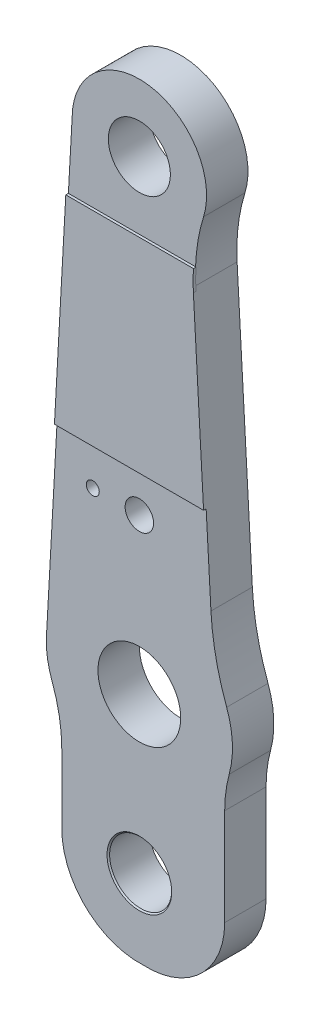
ISO-10303-21;
HEADER;
FILE_DESCRIPTION(('STEP AP214'),'2;1');
FILE_NAME('part.step','',(''),(''),'','','');
FILE_SCHEMA(('AUTOMOTIVE_DESIGN { 1 0 10303 214 1 1 1 1 }'));
ENDSEC;
DATA;
#1=APPLICATION_CONTEXT('core data for automotive mechanical design processes');
#2=APPLICATION_PROTOCOL_DEFINITION('international standard','automotive_design',2000,#1);
#3=PRODUCT_CONTEXT('',#1,'mechanical');
#4=PRODUCT('Part','Part','',(#3));
#5=PRODUCT_RELATED_PRODUCT_CATEGORY('part','',(#4));
#6=PRODUCT_DEFINITION_FORMATION('','',#4);
#7=PRODUCT_DEFINITION_CONTEXT('part definition',#1,'design');
#8=PRODUCT_DEFINITION('design','',#6,#7);
#9=PRODUCT_DEFINITION_SHAPE('','',#8);
#10=(LENGTH_UNIT() NAMED_UNIT(*) SI_UNIT(.MILLI.,.METRE.));
#11=(NAMED_UNIT(*) PLANE_ANGLE_UNIT() SI_UNIT($,.RADIAN.));
#12=(NAMED_UNIT(*) SI_UNIT($,.STERADIAN.) SOLID_ANGLE_UNIT());
#13=UNCERTAINTY_MEASURE_WITH_UNIT(LENGTH_MEASURE(1.E-05),#10,'distance_accuracy_value','');
#14=(GEOMETRIC_REPRESENTATION_CONTEXT(3) GLOBAL_UNCERTAINTY_ASSIGNED_CONTEXT((#13)) GLOBAL_UNIT_ASSIGNED_CONTEXT((#10,
#11,#12)) REPRESENTATION_CONTEXT('',''));
#15=CARTESIAN_POINT('',(0.,0.,0.));
#16=DIRECTION('',(0.,0.,1.));
#17=DIRECTION('',(1.,0.,0.));
#18=AXIS2_PLACEMENT_3D('',#15,#16,#17);
#19=CARTESIAN_POINT('',(3.5527136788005E-12,-179.999999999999,16.));
#20=DIRECTION('',(0.,0.,1.));
#21=DIRECTION('',(0.999999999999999,0.,0.));
#22=AXIS2_PLACEMENT_3D('',#19,#20,#21);
#23=PLANE('',#22);
#24=CARTESIAN_POINT('',(-17.9999999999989,-119.999999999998,16.));
#25=DIRECTION('',(0.,0.,1.));
#26=DIRECTION('',(0.999999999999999,0.,0.));
#27=AXIS2_PLACEMENT_3D('',#24,#25,#26);
#28=CIRCLE('',#27,2.5);
#29=CARTESIAN_POINT('',(-15.4999999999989,-119.999999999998,16.));
#30=VERTEX_POINT('',#29);
#31=EDGE_CURVE('E617',#30,#30,#28,.T.);
#32=ORIENTED_EDGE('',*,*,#31,.F.);
#33=EDGE_LOOP('',(#32));
#34=FACE_BOUND('',#33,.T.);
#35=CARTESIAN_POINT('',(3.5527136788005E-12,-179.999999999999,16.));
#36=DIRECTION('',(0.,0.,1.));
#37=DIRECTION('',(0.999999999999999,0.,0.));
#38=AXIS2_PLACEMENT_3D('',#35,#36,#37);
#39=CIRCLE('',#38,16.);
#40=CARTESIAN_POINT('',(16.0000000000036,-179.999999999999,16.));
#41=VERTEX_POINT('',#40);
#42=EDGE_CURVE('E196',#41,#41,#39,.T.);
#43=ORIENTED_EDGE('',*,*,#42,.F.);
#44=EDGE_LOOP('',(#43));
#45=FACE_BOUND('',#44,.T.);
#46=CARTESIAN_POINT('',(0.,-240.,16.));
#47=DIRECTION('',(0.,0.,1.));
#48=DIRECTION('',(0.999999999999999,0.,0.));
#49=AXIS2_PLACEMENT_3D('',#46,#47,#48);
#50=CIRCLE('',#49,12.5);
#51=CARTESIAN_POINT('',(12.5,-240.,16.));
#52=VERTEX_POINT('',#51);
#53=EDGE_CURVE('E11',#52,#52,#50,.F.);
#54=ORIENTED_EDGE('',*,*,#53,.T.);
#55=EDGE_LOOP('',(#54));
#56=FACE_BOUND('',#55,.T.);
#57=DIRECTION('',(0.999999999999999,0.,0.));
#58=VECTOR('',#57,1.);
#59=CARTESIAN_POINT('',(-31.8333333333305,-105.,16.));
#60=LINE('',#59,#58);
#61=CARTESIAN_POINT('',(-31.8333333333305,-105.,16.));
#62=VERTEX_POINT('',#61);
#63=CARTESIAN_POINT('',(25.8333333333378,-105.000000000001,16.));
#64=VERTEX_POINT('',#63);
#65=EDGE_CURVE('E54',#62,#64,#60,.T.);
#66=ORIENTED_EDGE('',*,*,#65,.F.);
#67=DIRECTION('',(-0.055470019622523,-0.998460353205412,0.));
#68=VECTOR('',#67,1.);
#69=CARTESIAN_POINT('',(-25.9999999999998,0.,16.));
#70=LINE('',#69,#68);
#71=CARTESIAN_POINT('',(-35.7784615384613,-176.012307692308,16.));
#72=VERTEX_POINT('',#71);
#73=EDGE_CURVE('E335',#62,#72,#70,.T.);
#74=ORIENTED_EDGE('',*,*,#73,.T.);
#75=CARTESIAN_POINT('',(3.5527136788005E-12,-179.999999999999,16.));
#76=DIRECTION('',(0.,0.,1.));
#77=DIRECTION('',(0.999999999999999,0.,0.));
#78=AXIS2_PLACEMENT_3D('',#75,#76,#77);
#79=CIRCLE('',#78,36.);
#80=CARTESIAN_POINT('',(-33.7499999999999,-192.527469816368,16.));
#81=VERTEX_POINT('',#80);
#82=EDGE_CURVE('E261',#72,#81,#79,.T.);
#83=ORIENTED_EDGE('',*,*,#82,.T.);
#84=CARTESIAN_POINT('',(-89.9999999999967,-213.406586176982,16.));
#85=DIRECTION('',(0.,0.,-1.));
#86=DIRECTION('',(-0.999999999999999,0.,0.));
#87=AXIS2_PLACEMENT_3D('',#84,#85,#86);
#88=CIRCLE('',#87,60.);
#89=CARTESIAN_POINT('',(-29.9999999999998,-213.40658617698,16.));
#90=VERTEX_POINT('',#89);
#91=EDGE_CURVE('E264',#81,#90,#88,.T.);
#92=ORIENTED_EDGE('',*,*,#91,.T.);
#93=DIRECTION('',(0.,-0.999999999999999,0.));
#94=VECTOR('',#93,1.);
#95=CARTESIAN_POINT('',(-29.9999999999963,-240.000000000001,16.));
#96=LINE('',#95,#94);
#97=CARTESIAN_POINT('',(-29.9999999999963,-240.000000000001,16.));
#98=VERTEX_POINT('',#97);
#99=EDGE_CURVE('E266',#90,#98,#96,.T.);
#100=ORIENTED_EDGE('',*,*,#99,.T.);
#101=CARTESIAN_POINT('',(0.,-240.,16.));
#102=DIRECTION('',(0.,0.,1.));
#103=DIRECTION('',(0.999999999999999,0.,0.));
#104=AXIS2_PLACEMENT_3D('',#101,#102,#103);
#105=CIRCLE('',#104,30.);
#106=CARTESIAN_POINT('',(1.5000000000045,-269.962476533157,16.));
#107=VERTEX_POINT('',#106);
#108=EDGE_CURVE('E268',#98,#107,#105,.T.);
#109=ORIENTED_EDGE('',*,*,#108,.T.);
#110=CARTESIAN_POINT('',(3.00000000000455,-239.999999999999,16.));
#111=DIRECTION('',(0.,0.,1.));
#112=DIRECTION('',(0.999999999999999,0.,0.));
#113=AXIS2_PLACEMENT_3D('',#110,#111,#112);
#114=CIRCLE('',#113,30.);
#115=CARTESIAN_POINT('',(33.0000000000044,-239.999999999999,16.));
#116=VERTEX_POINT('',#115);
#117=EDGE_CURVE('E270',#107,#116,#114,.T.);
#118=ORIENTED_EDGE('',*,*,#117,.T.);
#119=DIRECTION('',(0.,0.999999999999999,0.));
#120=VECTOR('',#119,1.);
#121=CARTESIAN_POINT('',(33.0000000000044,-239.999999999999,16.));
#122=LINE('',#121,#120);
#123=CARTESIAN_POINT('',(32.9999999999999,-202.516660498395,16.));
#124=VERTEX_POINT('',#123);
#125=EDGE_CURVE('E272',#116,#124,#122,.T.);
#126=ORIENTED_EDGE('',*,*,#125,.T.);
#127=CARTESIAN_POINT('',(83.0000000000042,-202.516660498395,16.));
#128=DIRECTION('',(0.,0.,-1.));
#129=DIRECTION('',(-0.999999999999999,0.,0.));
#130=AXIS2_PLACEMENT_3D('',#127,#128,#129);
#131=CIRCLE('',#130,50.);
#132=CARTESIAN_POINT('',(34.7441860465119,-189.425578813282,16.));
#133=VERTEX_POINT('',#132);
#134=EDGE_CURVE('E274',#124,#133,#131,.T.);
#135=ORIENTED_EDGE('',*,*,#134,.T.);
#136=CARTESIAN_POINT('',(3.5527136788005E-12,-179.999999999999,16.));
#137=DIRECTION('',(0.,0.,1.));
#138=DIRECTION('',(0.999999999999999,0.,0.));
#139=AXIS2_PLACEMENT_3D('',#136,#137,#138);
#140=CIRCLE('',#139,36.);
#141=CARTESIAN_POINT('',(33.7577775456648,-167.493503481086,16.));
#142=VERTEX_POINT('',#141);
#143=EDGE_CURVE('E276',#133,#142,#140,.T.);
#144=ORIENTED_EDGE('',*,*,#143,.T.);
#145=CARTESIAN_POINT('',(127.529381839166,-132.753235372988,16.));
#146=DIRECTION('',(0.,0.,-1.));
#147=DIRECTION('',(0.999999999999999,0.,0.));
#148=AXIS2_PLACEMENT_3D('',#145,#146,#147);
#149=CIRCLE('',#148,100.);
#150=CARTESIAN_POINT('',(27.6833465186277,-138.300237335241,16.));
#151=VERTEX_POINT('',#150);
#152=EDGE_CURVE('E278',#142,#151,#149,.T.);
#153=ORIENTED_EDGE('',*,*,#152,.T.);
#154=DIRECTION('',(-0.0554700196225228,0.998460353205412,0.));
#155=VECTOR('',#154,1.);
#156=CARTESIAN_POINT('',(21.7961207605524,-32.3301736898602,16.));
#157=LINE('',#156,#155);
#158=EDGE_CURVE('E288',#151,#64,#157,.T.);
#159=ORIENTED_EDGE('',*,*,#158,.T.);
#160=EDGE_LOOP('',(#66,#74,#83,#92,#100,#109,#118,#126,#135,#144,#153,#159));
#161=FACE_BOUND('',#160,.T.);
#162=CARTESIAN_POINT('',(0.,-120.,16.));
#163=DIRECTION('',(0.,0.,1.));
#164=DIRECTION('',(0.999999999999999,0.,0.));
#165=AXIS2_PLACEMENT_3D('',#162,#163,#164);
#166=CIRCLE('',#165,5.5);
#167=CARTESIAN_POINT('',(5.49999999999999,-120.,16.));
#168=VERTEX_POINT('',#167);
#169=EDGE_CURVE('E222',#168,#168,#166,.T.);
#170=ORIENTED_EDGE('',*,*,#169,.F.);
#171=EDGE_LOOP('',(#170));
#172=FACE_BOUND('',#171,.T.);
#173=ADVANCED_FACE('F39',(#34,#45,#56,#161,#172),#23,.T.);
#174=DIRECTION('',(-0.999999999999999,0.,0.));
#175=VECTOR('',#174,1.);
#176=CARTESIAN_POINT('',(-27.4444444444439,-25.9999999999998,16.));
#177=LINE('',#176,#175);
#178=CARTESIAN_POINT('',(21.7311381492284,-26.0000000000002,16.));
#179=VERTEX_POINT('',#178);
#180=CARTESIAN_POINT('',(-27.4444444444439,-25.9999999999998,16.));
#181=VERTEX_POINT('',#180);
#182=EDGE_CURVE('E62',#179,#181,#177,.T.);
#183=ORIENTED_EDGE('',*,*,#182,.F.);
#184=CARTESIAN_POINT('',(91.6883454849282,-28.4472723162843,16.));
#185=DIRECTION('',(0.,0.,-1.));
#186=DIRECTION('',(-0.999999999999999,0.,0.));
#187=AXIS2_PLACEMENT_3D('',#184,#185,#186);
#188=CIRCLE('',#187,70.);
#189=CARTESIAN_POINT('',(24.8322602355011,-7.70446958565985,16.));
#190=VERTEX_POINT('',#189);
#191=EDGE_CURVE('E290',#179,#190,#188,.T.);
#192=ORIENTED_EDGE('',*,*,#191,.T.);
#193=CARTESIAN_POINT('',(0.,0.,16.));
#194=DIRECTION('',(0.,0.,1.));
#195=DIRECTION('',(0.999999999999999,0.,0.));
#196=AXIS2_PLACEMENT_3D('',#193,#194,#195);
#197=CIRCLE('',#196,26.);
#198=CARTESIAN_POINT('',(-25.9999999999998,0.,16.));
#199=VERTEX_POINT('',#198);
#200=EDGE_CURVE('E332',#190,#199,#197,.T.);
#201=ORIENTED_EDGE('',*,*,#200,.T.);
#202=EDGE_CURVE('E330',#199,#181,#70,.T.);
#203=ORIENTED_EDGE('',*,*,#202,.T.);
#204=EDGE_LOOP('',(#183,#192,#201,#203));
#205=FACE_BOUND('',#204,.T.);
#206=CARTESIAN_POINT('',(0.,0.,16.));
#207=DIRECTION('',(0.,0.,1.));
#208=DIRECTION('',(0.999999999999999,0.,0.));
#209=AXIS2_PLACEMENT_3D('',#206,#207,#208);
#210=CIRCLE('',#209,12.);
#211=CARTESIAN_POINT('',(12.,0.,16.));
#212=VERTEX_POINT('',#211);
#213=EDGE_CURVE('E231',#212,#212,#210,.T.);
#214=ORIENTED_EDGE('',*,*,#213,.F.);
#215=EDGE_LOOP('',(#214));
#216=FACE_BOUND('',#215,.T.);
#217=ADVANCED_FACE('F342',(#205,#216),#23,.T.);
#218=CARTESIAN_POINT('',(3.5527136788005E-12,-179.999999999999,0.));
#219=DIRECTION('',(0.,0.,1.));
#220=DIRECTION('',(0.999999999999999,0.,0.));
#221=AXIS2_PLACEMENT_3D('',#218,#219,#220);
#222=PLANE('',#221);
#223=CARTESIAN_POINT('',(-17.9999999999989,-119.999999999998,0.));
#224=DIRECTION('',(0.,0.,1.));
#225=DIRECTION('',(0.999999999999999,0.,0.));
#226=AXIS2_PLACEMENT_3D('',#223,#224,#225);
#227=CIRCLE('',#226,2.5);
#228=CARTESIAN_POINT('',(-15.4999999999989,-119.999999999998,0.));
#229=VERTEX_POINT('',#228);
#230=EDGE_CURVE('E615',#229,#229,#227,.T.);
#231=ORIENTED_EDGE('',*,*,#230,.T.);
#232=EDGE_LOOP('',(#231));
#233=FACE_BOUND('',#232,.T.);
#234=CARTESIAN_POINT('',(3.5527136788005E-12,-179.999999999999,0.));
#235=DIRECTION('',(0.,0.,1.));
#236=DIRECTION('',(0.999999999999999,0.,0.));
#237=AXIS2_PLACEMENT_3D('',#234,#235,#236);
#238=CIRCLE('',#237,16.);
#239=CARTESIAN_POINT('',(16.0000000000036,-179.999999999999,0.));
#240=VERTEX_POINT('',#239);
#241=EDGE_CURVE('E193',#240,#240,#238,.T.);
#242=ORIENTED_EDGE('',*,*,#241,.T.);
#243=EDGE_LOOP('',(#242));
#244=FACE_BOUND('',#243,.T.);
#245=CARTESIAN_POINT('',(0.,-240.,0.));
#246=DIRECTION('',(0.,0.,1.));
#247=DIRECTION('',(0.999999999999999,0.,0.));
#248=AXIS2_PLACEMENT_3D('',#245,#246,#247);
#249=CIRCLE('',#248,12.);
#250=CARTESIAN_POINT('',(12.,-240.,0.));
#251=VERTEX_POINT('',#250);
#252=EDGE_CURVE('E225',#251,#251,#249,.T.);
#253=ORIENTED_EDGE('',*,*,#252,.T.);
#254=EDGE_LOOP('',(#253));
#255=FACE_BOUND('',#254,.T.);
#256=CARTESIAN_POINT('',(3.5527136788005E-12,-179.999999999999,0.));
#257=DIRECTION('',(0.,0.,1.));
#258=DIRECTION('',(0.999999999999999,0.,0.));
#259=AXIS2_PLACEMENT_3D('',#256,#257,#258);
#260=CIRCLE('',#259,36.);
#261=CARTESIAN_POINT('',(-35.7784615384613,-176.012307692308,0.));
#262=VERTEX_POINT('',#261);
#263=CARTESIAN_POINT('',(-33.7499999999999,-192.527469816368,0.));
#264=VERTEX_POINT('',#263);
#265=EDGE_CURVE('E234',#262,#264,#260,.T.);
#266=ORIENTED_EDGE('',*,*,#265,.F.);
#267=DIRECTION('',(-0.055470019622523,-0.998460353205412,0.));
#268=VECTOR('',#267,1.);
#269=CARTESIAN_POINT('',(-25.9999999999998,0.,0.));
#270=LINE('',#269,#268);
#271=CARTESIAN_POINT('',(-25.9999999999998,0.,0.));
#272=VERTEX_POINT('',#271);
#273=EDGE_CURVE('E259',#272,#262,#270,.T.);
#274=ORIENTED_EDGE('',*,*,#273,.F.);
#275=CARTESIAN_POINT('',(0.,0.,0.));
#276=DIRECTION('',(0.,0.,1.));
#277=DIRECTION('',(0.999999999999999,0.,0.));
#278=AXIS2_PLACEMENT_3D('',#275,#276,#277);
#279=CIRCLE('',#278,26.);
#280=CARTESIAN_POINT('',(24.8322602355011,-7.70446958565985,0.));
#281=VERTEX_POINT('',#280);
#282=EDGE_CURVE('E257',#281,#272,#279,.T.);
#283=ORIENTED_EDGE('',*,*,#282,.F.);
#284=CARTESIAN_POINT('',(91.6883454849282,-28.4472723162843,0.));
#285=DIRECTION('',(0.,0.,-1.));
#286=DIRECTION('',(-0.999999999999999,0.,0.));
#287=AXIS2_PLACEMENT_3D('',#284,#285,#286);
#288=CIRCLE('',#287,70.);
#289=CARTESIAN_POINT('',(21.7961207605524,-32.3301736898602,0.));
#290=VERTEX_POINT('',#289);
#291=EDGE_CURVE('E255',#290,#281,#288,.T.);
#292=ORIENTED_EDGE('',*,*,#291,.F.);
#293=DIRECTION('',(-0.0554700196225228,0.998460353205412,0.));
#294=VECTOR('',#293,1.);
#295=CARTESIAN_POINT('',(21.7961207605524,-32.3301736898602,0.));
#296=LINE('',#295,#294);
#297=CARTESIAN_POINT('',(27.6833465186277,-138.300237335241,0.));
#298=VERTEX_POINT('',#297);
#299=EDGE_CURVE('E253',#298,#290,#296,.T.);
#300=ORIENTED_EDGE('',*,*,#299,.F.);
#301=CARTESIAN_POINT('',(127.529381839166,-132.753235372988,0.));
#302=DIRECTION('',(0.,0.,-1.));
#303=DIRECTION('',(0.999999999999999,0.,0.));
#304=AXIS2_PLACEMENT_3D('',#301,#302,#303);
#305=CIRCLE('',#304,100.);
#306=CARTESIAN_POINT('',(33.7577775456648,-167.493503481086,0.));
#307=VERTEX_POINT('',#306);
#308=EDGE_CURVE('E251',#307,#298,#305,.T.);
#309=ORIENTED_EDGE('',*,*,#308,.F.);
#310=CARTESIAN_POINT('',(3.5527136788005E-12,-179.999999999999,0.));
#311=DIRECTION('',(0.,0.,1.));
#312=DIRECTION('',(0.999999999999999,0.,0.));
#313=AXIS2_PLACEMENT_3D('',#310,#311,#312);
#314=CIRCLE('',#313,36.);
#315=CARTESIAN_POINT('',(34.7441860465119,-189.425578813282,0.));
#316=VERTEX_POINT('',#315);
#317=EDGE_CURVE('E249',#316,#307,#314,.T.);
#318=ORIENTED_EDGE('',*,*,#317,.F.);
#319=CARTESIAN_POINT('',(83.0000000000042,-202.516660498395,0.));
#320=DIRECTION('',(0.,0.,-1.));
#321=DIRECTION('',(-0.999999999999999,0.,0.));
#322=AXIS2_PLACEMENT_3D('',#319,#320,#321);
#323=CIRCLE('',#322,50.);
#324=CARTESIAN_POINT('',(32.9999999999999,-202.516660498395,0.));
#325=VERTEX_POINT('',#324);
#326=EDGE_CURVE('E247',#325,#316,#323,.T.);
#327=ORIENTED_EDGE('',*,*,#326,.F.);
#328=DIRECTION('',(0.,0.999999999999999,0.));
#329=VECTOR('',#328,1.);
#330=CARTESIAN_POINT('',(33.0000000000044,-239.999999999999,0.));
#331=LINE('',#330,#329);
#332=CARTESIAN_POINT('',(33.0000000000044,-239.999999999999,0.));
#333=VERTEX_POINT('',#332);
#334=EDGE_CURVE('E245',#333,#325,#331,.T.);
#335=ORIENTED_EDGE('',*,*,#334,.F.);
#336=CARTESIAN_POINT('',(3.00000000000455,-239.999999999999,0.));
#337=DIRECTION('',(0.,0.,1.));
#338=DIRECTION('',(0.999999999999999,0.,0.));
#339=AXIS2_PLACEMENT_3D('',#336,#337,#338);
#340=CIRCLE('',#339,30.);
#341=CARTESIAN_POINT('',(1.5000000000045,-269.962476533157,0.));
#342=VERTEX_POINT('',#341);
#343=EDGE_CURVE('E243',#342,#333,#340,.T.);
#344=ORIENTED_EDGE('',*,*,#343,.F.);
#345=CARTESIAN_POINT('',(0.,-240.,0.));
#346=DIRECTION('',(0.,0.,1.));
#347=DIRECTION('',(0.999999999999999,0.,0.));
#348=AXIS2_PLACEMENT_3D('',#345,#346,#347);
#349=CIRCLE('',#348,30.);
#350=CARTESIAN_POINT('',(-29.9999999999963,-240.000000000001,0.));
#351=VERTEX_POINT('',#350);
#352=EDGE_CURVE('E241',#351,#342,#349,.T.);
#353=ORIENTED_EDGE('',*,*,#352,.F.);
#354=DIRECTION('',(0.,-0.999999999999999,0.));
#355=VECTOR('',#354,1.);
#356=CARTESIAN_POINT('',(-29.9999999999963,-240.000000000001,0.));
#357=LINE('',#356,#355);
#358=CARTESIAN_POINT('',(-29.9999999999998,-213.40658617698,0.));
#359=VERTEX_POINT('',#358);
#360=EDGE_CURVE('E239',#359,#351,#357,.T.);
#361=ORIENTED_EDGE('',*,*,#360,.F.);
#362=CARTESIAN_POINT('',(-89.9999999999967,-213.406586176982,0.));
#363=DIRECTION('',(0.,0.,-1.));
#364=DIRECTION('',(-0.999999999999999,0.,0.));
#365=AXIS2_PLACEMENT_3D('',#362,#363,#364);
#366=CIRCLE('',#365,60.);
#367=EDGE_CURVE('E237',#264,#359,#366,.T.);
#368=ORIENTED_EDGE('',*,*,#367,.F.);
#369=EDGE_LOOP('',(#266,#274,#283,#292,#300,#309,#318,#327,#335,#344,#353,#361,#368));
#370=FACE_BOUND('',#369,.T.);
#371=CARTESIAN_POINT('',(0.,0.,0.));
#372=DIRECTION('',(0.,0.,1.));
#373=DIRECTION('',(0.999999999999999,0.,0.));
#374=AXIS2_PLACEMENT_3D('',#371,#372,#373);
#375=CIRCLE('',#374,12.);
#376=CARTESIAN_POINT('',(12.,0.,0.));
#377=VERTEX_POINT('',#376);
#378=EDGE_CURVE('E228',#377,#377,#375,.T.);
#379=ORIENTED_EDGE('',*,*,#378,.T.);
#380=EDGE_LOOP('',(#379));
#381=FACE_BOUND('',#380,.T.);
#382=CARTESIAN_POINT('',(0.,-120.,0.));
#383=DIRECTION('',(0.,0.,1.));
#384=DIRECTION('',(0.999999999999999,0.,0.));
#385=AXIS2_PLACEMENT_3D('',#382,#383,#384);
#386=CIRCLE('',#385,5.5);
#387=CARTESIAN_POINT('',(5.49999999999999,-120.,0.));
#388=VERTEX_POINT('',#387);
#389=EDGE_CURVE('E186',#388,#388,#386,.T.);
#390=ORIENTED_EDGE('',*,*,#389,.T.);
#391=EDGE_LOOP('',(#390));
#392=FACE_BOUND('',#391,.T.);
#393=ADVANCED_FACE('F416',(#233,#244,#255,#370,#381,#392),#222,.F.);
#394=CARTESIAN_POINT('',(3.5527136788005E-12,-179.999999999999,16.));
#395=DIRECTION('',(0.,0.,-1.));
#396=DIRECTION('',(-0.999999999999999,0.,0.));
#397=AXIS2_PLACEMENT_3D('',#394,#395,#396);
#398=CYLINDRICAL_SURFACE('',#397,36.);
#399=ORIENTED_EDGE('',*,*,#265,.T.);
#400=DIRECTION('',(0.,0.,-1.));
#401=VECTOR('',#400,1.);
#402=CARTESIAN_POINT('',(-33.7499999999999,-192.527469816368,16.));
#403=LINE('',#402,#401);
#404=EDGE_CURVE('E291',#81,#264,#403,.T.);
#405=ORIENTED_EDGE('',*,*,#404,.F.);
#406=ORIENTED_EDGE('',*,*,#82,.F.);
#407=DIRECTION('',(0.,0.,-1.));
#408=VECTOR('',#407,1.);
#409=CARTESIAN_POINT('',(-35.7784615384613,-176.012307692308,16.));
#410=LINE('',#409,#408);
#411=EDGE_CURVE('E327',#72,#262,#410,.T.);
#412=ORIENTED_EDGE('',*,*,#411,.T.);
#413=EDGE_LOOP('',(#399,#405,#406,#412));
#414=FACE_BOUND('',#413,.T.);
#415=ADVANCED_FACE('F41',(#414),#398,.T.);
#416=CARTESIAN_POINT('',(-89.9999999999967,-213.406586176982,16.));
#417=DIRECTION('',(0.,0.,-1.));
#418=DIRECTION('',(-0.999999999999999,0.,0.));
#419=AXIS2_PLACEMENT_3D('',#416,#417,#418);
#420=CYLINDRICAL_SURFACE('',#419,60.);
#421=ORIENTED_EDGE('',*,*,#367,.T.);
#422=DIRECTION('',(0.,0.,-1.));
#423=VECTOR('',#422,1.);
#424=CARTESIAN_POINT('',(-29.9999999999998,-213.40658617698,16.));
#425=LINE('',#424,#423);
#426=EDGE_CURVE('E294',#90,#359,#425,.T.);
#427=ORIENTED_EDGE('',*,*,#426,.F.);
#428=ORIENTED_EDGE('',*,*,#91,.F.);
#429=ORIENTED_EDGE('',*,*,#404,.T.);
#430=EDGE_LOOP('',(#421,#427,#428,#429));
#431=FACE_BOUND('',#430,.T.);
#432=ADVANCED_FACE('F380',(#431),#420,.F.);
#433=CARTESIAN_POINT('',(-29.9999999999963,-240.000000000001,16.));
#434=DIRECTION('',(0.999999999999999,0.,0.));
#435=DIRECTION('',(0.,0.,-1.));
#436=AXIS2_PLACEMENT_3D('',#433,#434,#435);
#437=PLANE('',#436);
#438=ORIENTED_EDGE('',*,*,#360,.T.);
#439=DIRECTION('',(0.,0.,-1.));
#440=VECTOR('',#439,1.);
#441=CARTESIAN_POINT('',(-29.9999999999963,-240.000000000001,16.));
#442=LINE('',#441,#440);
#443=EDGE_CURVE('E297',#98,#351,#442,.T.);
#444=ORIENTED_EDGE('',*,*,#443,.F.);
#445=ORIENTED_EDGE('',*,*,#99,.F.);
#446=ORIENTED_EDGE('',*,*,#426,.T.);
#447=EDGE_LOOP('',(#438,#444,#445,#446));
#448=FACE_BOUND('',#447,.T.);
#449=ADVANCED_FACE('F383',(#448),#437,.F.);
#450=CARTESIAN_POINT('',(0.,-240.,16.));
#451=DIRECTION('',(0.,0.,-1.));
#452=DIRECTION('',(-0.999999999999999,0.,0.));
#453=AXIS2_PLACEMENT_3D('',#450,#451,#452);
#454=CYLINDRICAL_SURFACE('',#453,30.);
#455=ORIENTED_EDGE('',*,*,#352,.T.);
#456=DIRECTION('',(0.,0.,-1.));
#457=VECTOR('',#456,1.);
#458=CARTESIAN_POINT('',(1.5000000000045,-269.962476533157,16.));
#459=LINE('',#458,#457);
#460=EDGE_CURVE('E300',#107,#342,#459,.T.);
#461=ORIENTED_EDGE('',*,*,#460,.F.);
#462=ORIENTED_EDGE('',*,*,#108,.F.);
#463=ORIENTED_EDGE('',*,*,#443,.T.);
#464=EDGE_LOOP('',(#455,#461,#462,#463));
#465=FACE_BOUND('',#464,.T.);
#466=ADVANCED_FACE('F388',(#465),#454,.T.);
#467=CARTESIAN_POINT('',(3.00000000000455,-239.999999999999,16.));
#468=DIRECTION('',(0.,0.,-1.));
#469=DIRECTION('',(-0.999999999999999,0.,0.));
#470=AXIS2_PLACEMENT_3D('',#467,#468,#469);
#471=CYLINDRICAL_SURFACE('',#470,30.);
#472=ORIENTED_EDGE('',*,*,#343,.T.);
#473=DIRECTION('',(0.,0.,-1.));
#474=VECTOR('',#473,1.);
#475=CARTESIAN_POINT('',(33.0000000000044,-239.999999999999,16.));
#476=LINE('',#475,#474);
#477=EDGE_CURVE('E303',#116,#333,#476,.T.);
#478=ORIENTED_EDGE('',*,*,#477,.F.);
#479=ORIENTED_EDGE('',*,*,#117,.F.);
#480=ORIENTED_EDGE('',*,*,#460,.T.);
#481=EDGE_LOOP('',(#472,#478,#479,#480));
#482=FACE_BOUND('',#481,.T.);
#483=ADVANCED_FACE('F394',(#482),#471,.T.);
#484=CARTESIAN_POINT('',(33.0000000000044,-239.999999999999,16.));
#485=DIRECTION('',(-0.999999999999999,0.,0.));
#486=DIRECTION('',(0.,-0.999999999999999,0.));
#487=AXIS2_PLACEMENT_3D('',#484,#485,#486);
#488=PLANE('',#487);
#489=ORIENTED_EDGE('',*,*,#334,.T.);
#490=DIRECTION('',(0.,0.,-1.));
#491=VECTOR('',#490,1.);
#492=CARTESIAN_POINT('',(32.9999999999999,-202.516660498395,16.));
#493=LINE('',#492,#491);
#494=EDGE_CURVE('E306',#124,#325,#493,.T.);
#495=ORIENTED_EDGE('',*,*,#494,.F.);
#496=ORIENTED_EDGE('',*,*,#125,.F.);
#497=ORIENTED_EDGE('',*,*,#477,.T.);
#498=EDGE_LOOP('',(#489,#495,#496,#497));
#499=FACE_BOUND('',#498,.T.);
#500=ADVANCED_FACE('F398',(#499),#488,.F.);
#501=CARTESIAN_POINT('',(83.0000000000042,-202.516660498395,16.));
#502=DIRECTION('',(0.,0.,-1.));
#503=DIRECTION('',(-0.999999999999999,0.,0.));
#504=AXIS2_PLACEMENT_3D('',#501,#502,#503);
#505=CYLINDRICAL_SURFACE('',#504,50.);
#506=ORIENTED_EDGE('',*,*,#326,.T.);
#507=DIRECTION('',(0.,0.,-1.));
#508=VECTOR('',#507,1.);
#509=CARTESIAN_POINT('',(34.7441860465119,-189.425578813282,16.));
#510=LINE('',#509,#508);
#511=EDGE_CURVE('E309',#133,#316,#510,.T.);
#512=ORIENTED_EDGE('',*,*,#511,.F.);
#513=ORIENTED_EDGE('',*,*,#134,.F.);
#514=ORIENTED_EDGE('',*,*,#494,.T.);
#515=EDGE_LOOP('',(#506,#512,#513,#514));
#516=FACE_BOUND('',#515,.T.);
#517=ADVANCED_FACE('F403',(#516),#505,.F.);
#518=CARTESIAN_POINT('',(3.5527136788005E-12,-179.999999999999,16.));
#519=DIRECTION('',(0.,0.,-1.));
#520=DIRECTION('',(-0.999999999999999,0.,0.));
#521=AXIS2_PLACEMENT_3D('',#518,#519,#520);
#522=CYLINDRICAL_SURFACE('',#521,36.);
#523=ORIENTED_EDGE('',*,*,#317,.T.);
#524=DIRECTION('',(0.,0.,-1.));
#525=VECTOR('',#524,1.);
#526=CARTESIAN_POINT('',(33.7577775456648,-167.493503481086,16.));
#527=LINE('',#526,#525);
#528=EDGE_CURVE('E312',#142,#307,#527,.T.);
#529=ORIENTED_EDGE('',*,*,#528,.F.);
#530=ORIENTED_EDGE('',*,*,#143,.F.);
#531=ORIENTED_EDGE('',*,*,#511,.T.);
#532=EDGE_LOOP('',(#523,#529,#530,#531));
#533=FACE_BOUND('',#532,.T.);
#534=ADVANCED_FACE('F409',(#533),#522,.T.);
#535=CARTESIAN_POINT('',(127.529381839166,-132.753235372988,16.));
#536=DIRECTION('',(0.,0.,-1.));
#537=DIRECTION('',(-0.999999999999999,0.,0.));
#538=AXIS2_PLACEMENT_3D('',#535,#536,#537);
#539=CYLINDRICAL_SURFACE('',#538,100.);
#540=ORIENTED_EDGE('',*,*,#308,.T.);
#541=DIRECTION('',(0.,0.,-1.));
#542=VECTOR('',#541,1.);
#543=CARTESIAN_POINT('',(27.6833465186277,-138.300237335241,16.));
#544=LINE('',#543,#542);
#545=EDGE_CURVE('E315',#151,#298,#544,.T.);
#546=ORIENTED_EDGE('',*,*,#545,.F.);
#547=ORIENTED_EDGE('',*,*,#152,.F.);
#548=ORIENTED_EDGE('',*,*,#528,.T.);
#549=EDGE_LOOP('',(#540,#546,#547,#548));
#550=FACE_BOUND('',#549,.T.);
#551=ADVANCED_FACE('F413',(#550),#539,.F.);
#552=CARTESIAN_POINT('',(21.7961207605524,-32.3301736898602,16.));
#553=DIRECTION('',(-0.998460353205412,-0.0554700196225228,0.));
#554=DIRECTION('',(0.0554700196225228,-0.998460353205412,0.));
#555=AXIS2_PLACEMENT_3D('',#552,#553,#554);
#556=PLANE('',#555);
#557=ORIENTED_EDGE('',*,*,#299,.T.);
#558=DIRECTION('',(0.,0.,-1.));
#559=VECTOR('',#558,1.);
#560=CARTESIAN_POINT('',(21.7961207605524,-32.3301736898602,16.));
#561=LINE('',#560,#559);
#562=CARTESIAN_POINT('',(21.7961207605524,-32.3301736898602,16.));
#563=VERTEX_POINT('',#562);
#564=EDGE_CURVE('E318',#563,#290,#561,.T.);
#565=ORIENTED_EDGE('',*,*,#564,.F.);
#566=CARTESIAN_POINT('',(21.896484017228,-34.1367123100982,16.));
#567=VERTEX_POINT('',#566);
#568=EDGE_CURVE('E280',#567,#563,#157,.T.);
#569=ORIENTED_EDGE('',*,*,#568,.F.);
#570=DIRECTION('',(0.,0.,-1.));
#571=VECTOR('',#570,1.);
#572=CARTESIAN_POINT('',(21.8964840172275,-34.1367123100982,16.9999999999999));
#573=LINE('',#572,#571);
#574=CARTESIAN_POINT('',(21.8964840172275,-34.1367123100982,16.9999999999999));
#575=VERTEX_POINT('',#574);
#576=EDGE_CURVE('E192',#575,#567,#573,.T.);
#577=ORIENTED_EDGE('',*,*,#576,.F.);
#578=DIRECTION('',(-0.0554700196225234,0.998460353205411,0.));
#579=VECTOR('',#578,1.);
#580=CARTESIAN_POINT('',(21.8964840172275,-34.1367123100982,16.9999999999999));
#581=LINE('',#580,#579);
#582=CARTESIAN_POINT('',(25.8333333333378,-105.000000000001,16.9999999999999));
#583=VERTEX_POINT('',#582);
#584=EDGE_CURVE('E218',#583,#575,#581,.T.);
#585=ORIENTED_EDGE('',*,*,#584,.F.);
#586=DIRECTION('',(0.,0.,-1.));
#587=VECTOR('',#586,1.);
#588=CARTESIAN_POINT('',(25.8333333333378,-105.000000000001,16.9999999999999));
#589=LINE('',#588,#587);
#590=EDGE_CURVE('E207',#583,#64,#589,.T.);
#591=ORIENTED_EDGE('',*,*,#590,.T.);
#592=ORIENTED_EDGE('',*,*,#158,.F.);
#593=ORIENTED_EDGE('',*,*,#545,.T.);
#594=EDGE_LOOP('',(#557,#565,#569,#577,#585,#591,#592,#593));
#595=FACE_BOUND('',#594,.T.);
#596=ADVANCED_FACE('F367',(#595),#556,.F.);
#597=CARTESIAN_POINT('',(91.6883454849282,-28.4472723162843,16.));
#598=DIRECTION('',(0.,0.,-1.));
#599=DIRECTION('',(-0.999999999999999,0.,0.));
#600=AXIS2_PLACEMENT_3D('',#597,#598,#599);
#601=CYLINDRICAL_SURFACE('',#600,70.);
#602=ORIENTED_EDGE('',*,*,#291,.T.);
#603=DIRECTION('',(0.,0.,-1.));
#604=VECTOR('',#603,1.);
#605=CARTESIAN_POINT('',(24.8322602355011,-7.70446958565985,16.));
#606=LINE('',#605,#604);
#607=EDGE_CURVE('E321',#190,#281,#606,.T.);
#608=ORIENTED_EDGE('',*,*,#607,.F.);
#609=ORIENTED_EDGE('',*,*,#191,.F.);
#610=EDGE_CURVE('E175',#563,#179,#188,.T.);
#611=ORIENTED_EDGE('',*,*,#610,.F.);
#612=ORIENTED_EDGE('',*,*,#564,.T.);
#613=EDGE_LOOP('',(#602,#608,#609,#611,#612));
#614=FACE_BOUND('',#613,.T.);
#615=ADVANCED_FACE('F345',(#614),#601,.F.);
#616=CARTESIAN_POINT('',(0.,0.,16.));
#617=DIRECTION('',(0.,0.,-1.));
#618=DIRECTION('',(-0.999999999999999,0.,0.));
#619=AXIS2_PLACEMENT_3D('',#616,#617,#618);
#620=CYLINDRICAL_SURFACE('',#619,26.);
#621=ORIENTED_EDGE('',*,*,#282,.T.);
#622=DIRECTION('',(0.,0.,-1.));
#623=VECTOR('',#622,1.);
#624=CARTESIAN_POINT('',(-25.9999999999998,0.,16.));
#625=LINE('',#624,#623);
#626=EDGE_CURVE('E324',#199,#272,#625,.T.);
#627=ORIENTED_EDGE('',*,*,#626,.F.);
#628=ORIENTED_EDGE('',*,*,#200,.F.);
#629=ORIENTED_EDGE('',*,*,#607,.T.);
#630=EDGE_LOOP('',(#621,#627,#628,#629));
#631=FACE_BOUND('',#630,.T.);
#632=ADVANCED_FACE('F349',(#631),#620,.T.);
#633=CARTESIAN_POINT('',(-25.9999999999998,0.,16.));
#634=DIRECTION('',(0.998460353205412,-0.055470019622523,0.));
#635=DIRECTION('',(0.055470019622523,0.998460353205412,0.));
#636=AXIS2_PLACEMENT_3D('',#633,#634,#635);
#637=PLANE('',#636);
#638=ORIENTED_EDGE('',*,*,#273,.T.);
#639=ORIENTED_EDGE('',*,*,#411,.F.);
#640=ORIENTED_EDGE('',*,*,#73,.F.);
#641=DIRECTION('',(0.,0.,-1.));
#642=VECTOR('',#641,1.);
#643=CARTESIAN_POINT('',(-31.8333333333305,-105.,16.9999999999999));
#644=LINE('',#643,#642);
#645=CARTESIAN_POINT('',(-31.8333333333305,-105.,16.9999999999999));
#646=VERTEX_POINT('',#645);
#647=EDGE_CURVE('E356',#646,#62,#644,.T.);
#648=ORIENTED_EDGE('',*,*,#647,.F.);
#649=DIRECTION('',(-0.055470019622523,-0.998460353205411,0.));
#650=VECTOR('',#649,1.);
#651=CARTESIAN_POINT('',(-27.4444444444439,-25.9999999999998,16.9999999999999));
#652=LINE('',#651,#650);
#653=CARTESIAN_POINT('',(-27.4444444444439,-25.9999999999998,16.9999999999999));
#654=VERTEX_POINT('',#653);
#655=EDGE_CURVE('E214',#654,#646,#652,.T.);
#656=ORIENTED_EDGE('',*,*,#655,.F.);
#657=DIRECTION('',(0.,0.,-1.));
#658=VECTOR('',#657,1.);
#659=CARTESIAN_POINT('',(-27.4444444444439,-25.9999999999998,16.9999999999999));
#660=LINE('',#659,#658);
#661=EDGE_CURVE('E187',#654,#181,#660,.T.);
#662=ORIENTED_EDGE('',*,*,#661,.T.);
#663=ORIENTED_EDGE('',*,*,#202,.F.);
#664=ORIENTED_EDGE('',*,*,#626,.T.);
#665=EDGE_LOOP('',(#638,#639,#640,#648,#656,#662,#663,#664));
#666=FACE_BOUND('',#665,.T.);
#667=ADVANCED_FACE('F353',(#666),#637,.F.);
#668=CARTESIAN_POINT('',(0.,0.,16.));
#669=DIRECTION('',(0.,0.,-1.));
#670=DIRECTION('',(-0.999999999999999,0.,0.));
#671=AXIS2_PLACEMENT_3D('',#668,#669,#670);
#672=CYLINDRICAL_SURFACE('',#671,12.);
#673=ORIENTED_EDGE('',*,*,#213,.T.);
#674=EDGE_LOOP('',(#673));
#675=FACE_BOUND('',#674,.T.);
#676=ORIENTED_EDGE('',*,*,#378,.F.);
#677=EDGE_LOOP('',(#676));
#678=FACE_BOUND('',#677,.T.);
#679=ADVANCED_FACE('F435',(#675,#678),#672,.F.);
#680=CARTESIAN_POINT('',(0.,-240.,16.));
#681=DIRECTION('',(0.,0.,-1.));
#682=DIRECTION('',(-0.999999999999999,0.,0.));
#683=AXIS2_PLACEMENT_3D('',#680,#681,#682);
#684=CYLINDRICAL_SURFACE('',#683,12.);
#685=CARTESIAN_POINT('',(0.,-240.,15.5000000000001));
#686=DIRECTION('',(0.,0.,1.));
#687=DIRECTION('',(0.999999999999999,0.,0.));
#688=AXIS2_PLACEMENT_3D('',#685,#686,#687);
#689=CIRCLE('',#688,12.);
#690=CARTESIAN_POINT('',(12.,-240.,15.5000000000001));
#691=VERTEX_POINT('',#690);
#692=EDGE_CURVE('E47',#691,#691,#689,.T.);
#693=ORIENTED_EDGE('',*,*,#692,.T.);
#694=EDGE_LOOP('',(#693));
#695=FACE_BOUND('',#694,.T.);
#696=ORIENTED_EDGE('',*,*,#252,.F.);
#697=EDGE_LOOP('',(#696));
#698=FACE_BOUND('',#697,.T.);
#699=ADVANCED_FACE('F427',(#695,#698),#684,.F.);
#700=CARTESIAN_POINT('',(0.,-120.,16.));
#701=DIRECTION('',(0.,0.,-1.));
#702=DIRECTION('',(-0.999999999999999,0.,0.));
#703=AXIS2_PLACEMENT_3D('',#700,#701,#702);
#704=CYLINDRICAL_SURFACE('',#703,5.5);
#705=ORIENTED_EDGE('',*,*,#169,.T.);
#706=EDGE_LOOP('',(#705));
#707=FACE_BOUND('',#706,.T.);
#708=ORIENTED_EDGE('',*,*,#389,.F.);
#709=EDGE_LOOP('',(#708));
#710=FACE_BOUND('',#709,.T.);
#711=ADVANCED_FACE('F425',(#707,#710),#704,.F.);
#712=CARTESIAN_POINT('',(91.7887087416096,-30.2538109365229,16.9999999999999));
#713=DIRECTION('',(0.,0.,-1.));
#714=DIRECTION('',(-0.999999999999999,0.,0.));
#715=AXIS2_PLACEMENT_3D('',#712,#713,#714);
#716=CYLINDRICAL_SURFACE('',#715,70.);
#717=CARTESIAN_POINT('',(91.7887087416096,-30.2538109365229,16.));
#718=DIRECTION('',(0.,0.,-1.));
#719=DIRECTION('',(-0.999999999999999,0.,0.));
#720=AXIS2_PLACEMENT_3D('',#717,#718,#719);
#721=CIRCLE('',#720,70.);
#722=CARTESIAN_POINT('',(21.9180776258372,-26.0000000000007,16.));
#723=VERTEX_POINT('',#722);
#724=EDGE_CURVE('E173',#567,#723,#721,.T.);
#725=ORIENTED_EDGE('',*,*,#724,.T.);
#726=DIRECTION('',(0.,0.,-1.));
#727=VECTOR('',#726,1.);
#728=CARTESIAN_POINT('',(21.9180776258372,-26.0000000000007,16.9999999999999));
#729=LINE('',#728,#727);
#730=CARTESIAN_POINT('',(21.9180776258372,-26.0000000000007,16.9999999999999));
#731=VERTEX_POINT('',#730);
#732=EDGE_CURVE('E179',#731,#723,#729,.T.);
#733=ORIENTED_EDGE('',*,*,#732,.F.);
#734=CARTESIAN_POINT('',(91.7887087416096,-30.2538109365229,16.9999999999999));
#735=DIRECTION('',(0.,0.,-1.));
#736=DIRECTION('',(-0.999999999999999,0.,0.));
#737=AXIS2_PLACEMENT_3D('',#734,#735,#736);
#738=CIRCLE('',#737,70.);
#739=EDGE_CURVE('E206',#575,#731,#738,.T.);
#740=ORIENTED_EDGE('',*,*,#739,.F.);
#741=ORIENTED_EDGE('',*,*,#576,.T.);
#742=EDGE_LOOP('',(#725,#733,#740,#741));
#743=FACE_BOUND('',#742,.T.);
#744=ADVANCED_FACE('F190',(#743),#716,.F.);
#745=CARTESIAN_POINT('',(-27.4444444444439,-25.9999999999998,16.9999999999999));
#746=DIRECTION('',(0.,-0.999999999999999,0.));
#747=DIRECTION('',(0.,0.,-1.));
#748=AXIS2_PLACEMENT_3D('',#745,#746,#747);
#749=PLANE('',#748);
#750=EDGE_CURVE('E168',#723,#179,#177,.T.);
#751=ORIENTED_EDGE('',*,*,#750,.T.);
#752=ORIENTED_EDGE('',*,*,#182,.T.);
#753=ORIENTED_EDGE('',*,*,#661,.F.);
#754=DIRECTION('',(-0.999999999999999,0.,0.));
#755=VECTOR('',#754,1.);
#756=CARTESIAN_POINT('',(-27.4444444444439,-25.9999999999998,16.9999999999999));
#757=LINE('',#756,#755);
#758=EDGE_CURVE('E182',#731,#654,#757,.T.);
#759=ORIENTED_EDGE('',*,*,#758,.F.);
#760=ORIENTED_EDGE('',*,*,#732,.T.);
#761=EDGE_LOOP('',(#751,#752,#753,#759,#760));
#762=FACE_BOUND('',#761,.T.);
#763=ADVANCED_FACE('F180',(#762),#749,.F.);
#764=CARTESIAN_POINT('',(-31.8333333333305,-105.,16.9999999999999));
#765=DIRECTION('',(0.,0.999999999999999,0.));
#766=DIRECTION('',(0.,0.,1.));
#767=AXIS2_PLACEMENT_3D('',#764,#765,#766);
#768=PLANE('',#767);
#769=ORIENTED_EDGE('',*,*,#65,.T.);
#770=ORIENTED_EDGE('',*,*,#590,.F.);
#771=DIRECTION('',(0.999999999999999,0.,0.));
#772=VECTOR('',#771,1.);
#773=CARTESIAN_POINT('',(-31.8333333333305,-105.,16.9999999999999));
#774=LINE('',#773,#772);
#775=EDGE_CURVE('E216',#646,#583,#774,.T.);
#776=ORIENTED_EDGE('',*,*,#775,.F.);
#777=ORIENTED_EDGE('',*,*,#647,.T.);
#778=EDGE_LOOP('',(#769,#770,#776,#777));
#779=FACE_BOUND('',#778,.T.);
#780=ADVANCED_FACE('F370',(#779),#768,.F.);
#781=CARTESIAN_POINT('',(91.7887087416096,-30.2538109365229,16.9999999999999));
#782=DIRECTION('',(0.,0.,-1.));
#783=DIRECTION('',(-0.999999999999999,0.,0.));
#784=AXIS2_PLACEMENT_3D('',#781,#782,#783);
#785=PLANE('',#784);
#786=ORIENTED_EDGE('',*,*,#739,.T.);
#787=ORIENTED_EDGE('',*,*,#758,.T.);
#788=ORIENTED_EDGE('',*,*,#655,.T.);
#789=ORIENTED_EDGE('',*,*,#775,.T.);
#790=ORIENTED_EDGE('',*,*,#584,.T.);
#791=EDGE_LOOP('',(#786,#787,#788,#789,#790));
#792=FACE_BOUND('',#791,.T.);
#793=ADVANCED_FACE('F573',(#792),#785,.F.);
#794=CARTESIAN_POINT('',(91.7887087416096,-30.2538109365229,16.));
#795=DIRECTION('',(0.,0.,-1.));
#796=DIRECTION('',(-0.999999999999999,0.,0.));
#797=AXIS2_PLACEMENT_3D('',#794,#795,#796);
#798=PLANE('',#797);
#799=ORIENTED_EDGE('',*,*,#724,.F.);
#800=ORIENTED_EDGE('',*,*,#568,.T.);
#801=ORIENTED_EDGE('',*,*,#610,.T.);
#802=ORIENTED_EDGE('',*,*,#750,.F.);
#803=EDGE_LOOP('',(#799,#800,#801,#802));
#804=FACE_BOUND('',#803,.T.);
#805=ADVANCED_FACE('F170',(#804),#798,.T.);
#806=CARTESIAN_POINT('',(0.,-240.,15.5000000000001));
#807=DIRECTION('',(0.,0.,1.));
#808=DIRECTION('',(0.999999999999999,0.,0.));
#809=AXIS2_PLACEMENT_3D('',#806,#807,#808);
#810=CONICAL_SURFACE('',#809,12.,0.785398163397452);
#811=ORIENTED_EDGE('',*,*,#53,.F.);
#812=EDGE_LOOP('',(#811));
#813=FACE_BOUND('',#812,.T.);
#814=ORIENTED_EDGE('',*,*,#692,.F.);
#815=EDGE_LOOP('',(#814));
#816=FACE_BOUND('',#815,.T.);
#817=ADVANCED_FACE('F587',(#813,#816),#810,.F.);
#818=CARTESIAN_POINT('',(3.5527136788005E-12,-179.999999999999,0.));
#819=DIRECTION('',(0.,0.,1.));
#820=DIRECTION('',(0.999999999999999,0.,0.));
#821=AXIS2_PLACEMENT_3D('',#818,#819,#820);
#822=CYLINDRICAL_SURFACE('',#821,16.);
#823=ORIENTED_EDGE('',*,*,#241,.F.);
#824=EDGE_LOOP('',(#823));
#825=FACE_BOUND('',#824,.T.);
#826=ORIENTED_EDGE('',*,*,#42,.T.);
#827=EDGE_LOOP('',(#826));
#828=FACE_BOUND('',#827,.T.);
#829=ADVANCED_FACE('F594',(#825,#828),#822,.F.);
#830=CARTESIAN_POINT('',(-17.9999999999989,-119.999999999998,0.));
#831=DIRECTION('',(0.,0.,1.));
#832=DIRECTION('',(0.999999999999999,0.,0.));
#833=AXIS2_PLACEMENT_3D('',#830,#831,#832);
#834=CYLINDRICAL_SURFACE('',#833,2.5);
#835=ORIENTED_EDGE('',*,*,#230,.F.);
#836=EDGE_LOOP('',(#835));
#837=FACE_BOUND('',#836,.T.);
#838=ORIENTED_EDGE('',*,*,#31,.T.);
#839=EDGE_LOOP('',(#838));
#840=FACE_BOUND('',#839,.T.);
#841=ADVANCED_FACE('F602',(#837,#840),#834,.F.);
#842=CLOSED_SHELL('',(#173,#217,#393,#415,#432,#449,#466,#483,#500,#517,#534,#551,#596,#615,
#632,#667,#679,#699,#711,#744,#763,#780,#793,#805,#817,#829,#841));
#843=MANIFOLD_SOLID_BREP('B2',#842);
#844=ADVANCED_BREP_SHAPE_REPRESENTATION('',(#18,#843),#14);
#845=SHAPE_DEFINITION_REPRESENTATION(#9,#844);
ENDSEC;
END-ISO-10303-21;
